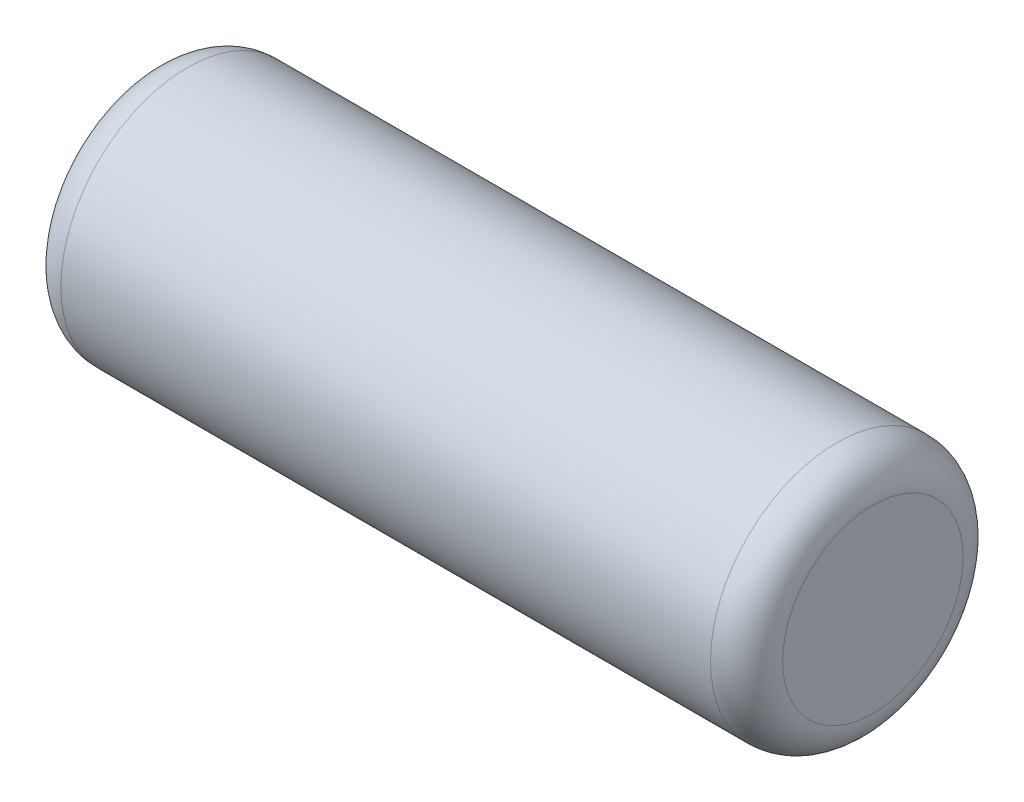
ISO-10303-21;
HEADER;
FILE_DESCRIPTION(('STEP AP214'),'2;1');
FILE_NAME('part.step','',(''),(''),'','','');
FILE_SCHEMA(('AUTOMOTIVE_DESIGN { 1 0 10303 214 1 1 1 1 }'));
ENDSEC;
DATA;
#1=APPLICATION_CONTEXT('core data for automotive mechanical design processes');
#2=APPLICATION_PROTOCOL_DEFINITION('international standard','automotive_design',2000,#1);
#3=PRODUCT_CONTEXT('',#1,'mechanical');
#4=PRODUCT('Part','Part','',(#3));
#5=PRODUCT_RELATED_PRODUCT_CATEGORY('part','',(#4));
#6=PRODUCT_DEFINITION_FORMATION('','',#4);
#7=PRODUCT_DEFINITION_CONTEXT('part definition',#1,'design');
#8=PRODUCT_DEFINITION('design','',#6,#7);
#9=PRODUCT_DEFINITION_SHAPE('','',#8);
#10=(LENGTH_UNIT() NAMED_UNIT(*) SI_UNIT(.MILLI.,.METRE.));
#11=(NAMED_UNIT(*) PLANE_ANGLE_UNIT() SI_UNIT($,.RADIAN.));
#12=(NAMED_UNIT(*) SI_UNIT($,.STERADIAN.) SOLID_ANGLE_UNIT());
#13=UNCERTAINTY_MEASURE_WITH_UNIT(LENGTH_MEASURE(1.E-05),#10,'distance_accuracy_value','');
#14=(GEOMETRIC_REPRESENTATION_CONTEXT(3) GLOBAL_UNCERTAINTY_ASSIGNED_CONTEXT((#13)) GLOBAL_UNIT_ASSIGNED_CONTEXT((#10,
#11,#12)) REPRESENTATION_CONTEXT('',''));
#15=CARTESIAN_POINT('',(0.,0.,0.));
#16=DIRECTION('',(0.,0.,1.));
#17=DIRECTION('',(1.,0.,0.));
#18=AXIS2_PLACEMENT_3D('',#15,#16,#17);
#19=CARTESIAN_POINT('',(0.,0.,0.));
#20=DIRECTION('',(1.,0.,0.));
#21=DIRECTION('',(0.,0.,-1.));
#22=AXIS2_PLACEMENT_3D('',#19,#20,#21);
#23=PLANE('',#22);
#24=CARTESIAN_POINT('',(0.,0.,0.));
#25=DIRECTION('',(1.,0.,0.));
#26=DIRECTION('',(0.,0.,-1.));
#27=AXIS2_PLACEMENT_3D('',#24,#25,#26);
#28=CIRCLE('',#27,5.);
#29=CARTESIAN_POINT('',(0.,0.,-5.));
#30=VERTEX_POINT('',#29);
#31=EDGE_CURVE('E29',#30,#30,#28,.F.);
#32=ORIENTED_EDGE('',*,*,#31,.T.);
#33=EDGE_LOOP('',(#32));
#34=FACE_BOUND('',#33,.T.);
#35=ADVANCED_FACE('F14',(#34),#23,.F.);
#36=CARTESIAN_POINT('',(0.,0.,0.));
#37=DIRECTION('',(-1.,0.,0.));
#38=DIRECTION('',(0.,0.,1.));
#39=AXIS2_PLACEMENT_3D('',#36,#37,#38);
#40=CYLINDRICAL_SURFACE('',#39,7.);
#41=CARTESIAN_POINT('',(2.,0.,0.));
#42=DIRECTION('',(1.,0.,0.));
#43=DIRECTION('',(0.,0.,-1.));
#44=AXIS2_PLACEMENT_3D('',#41,#42,#43);
#45=CIRCLE('',#44,7.);
#46=CARTESIAN_POINT('',(2.,0.,-7.));
#47=VERTEX_POINT('',#46);
#48=EDGE_CURVE('E21',#47,#47,#45,.T.);
#49=ORIENTED_EDGE('',*,*,#48,.T.);
#50=EDGE_LOOP('',(#49));
#51=FACE_BOUND('',#50,.T.);
#52=CARTESIAN_POINT('',(38.,0.,0.));
#53=DIRECTION('',(-1.,0.,0.));
#54=DIRECTION('',(0.,0.,1.));
#55=AXIS2_PLACEMENT_3D('',#52,#53,#54);
#56=CIRCLE('',#55,7.);
#57=CARTESIAN_POINT('',(38.,0.,7.));
#58=VERTEX_POINT('',#57);
#59=EDGE_CURVE('E25',#58,#58,#56,.T.);
#60=ORIENTED_EDGE('',*,*,#59,.T.);
#61=EDGE_LOOP('',(#60));
#62=FACE_BOUND('',#61,.T.);
#63=ADVANCED_FACE('F47',(#51,#62),#40,.T.);
#64=CARTESIAN_POINT('',(40.,7.,0.));
#65=DIRECTION('',(-1.,0.,0.));
#66=DIRECTION('',(0.,0.,1.));
#67=AXIS2_PLACEMENT_3D('',#64,#65,#66);
#68=PLANE('',#67);
#69=CARTESIAN_POINT('',(40.,0.,0.));
#70=DIRECTION('',(-1.,0.,0.));
#71=DIRECTION('',(0.,0.,1.));
#72=AXIS2_PLACEMENT_3D('',#69,#70,#71);
#73=CIRCLE('',#72,5.);
#74=CARTESIAN_POINT('',(40.,0.,5.));
#75=VERTEX_POINT('',#74);
#76=EDGE_CURVE('E9',#75,#75,#73,.F.);
#77=ORIENTED_EDGE('',*,*,#76,.T.);
#78=EDGE_LOOP('',(#77));
#79=FACE_BOUND('',#78,.T.);
#80=ADVANCED_FACE('F38',(#79),#68,.F.);
#81=CARTESIAN_POINT('',(2.,0.,0.));
#82=DIRECTION('',(1.,0.,0.));
#83=DIRECTION('',(0.,0.,-1.));
#84=AXIS2_PLACEMENT_3D('',#81,#82,#83);
#85=TOROIDAL_SURFACE('',#84,5.,2.);
#86=ORIENTED_EDGE('',*,*,#48,.F.);
#87=EDGE_LOOP('',(#86));
#88=FACE_BOUND('',#87,.T.);
#89=ORIENTED_EDGE('',*,*,#31,.F.);
#90=EDGE_LOOP('',(#89));
#91=FACE_BOUND('',#90,.T.);
#92=ADVANCED_FACE('F36',(#88,#91),#85,.T.);
#93=CARTESIAN_POINT('',(38.,0.,0.));
#94=DIRECTION('',(-1.,0.,0.));
#95=DIRECTION('',(0.,0.,1.));
#96=AXIS2_PLACEMENT_3D('',#93,#94,#95);
#97=TOROIDAL_SURFACE('',#96,5.,2.);
#98=ORIENTED_EDGE('',*,*,#76,.F.);
#99=EDGE_LOOP('',(#98));
#100=FACE_BOUND('',#99,.T.);
#101=ORIENTED_EDGE('',*,*,#59,.F.);
#102=EDGE_LOOP('',(#101));
#103=FACE_BOUND('',#102,.T.);
#104=ADVANCED_FACE('F16',(#100,#103),#97,.T.);
#105=CLOSED_SHELL('',(#35,#63,#80,#92,#104));
#106=MANIFOLD_SOLID_BREP('B1',#105);
#107=ADVANCED_BREP_SHAPE_REPRESENTATION('',(#18,#106),#14);
#108=SHAPE_DEFINITION_REPRESENTATION(#9,#107);
ENDSEC;
END-ISO-10303-21;
